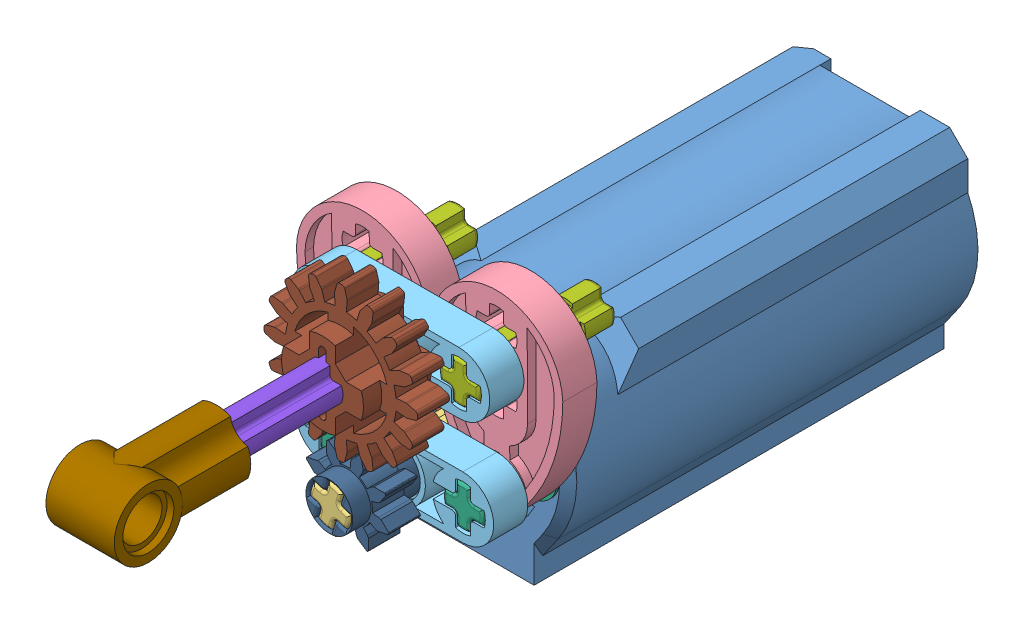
SolidWorks assembly 33.SLDASM, configuration 기본 (file format 9000). Lengths in mm.
Overall size (31.6 33.8 93.1).
15 component instances, 11 part files, 42 mates.
Components (placement in the parent):
- 9V Motor M-1: 9V Motor M.SLDPRT [기본] at (-8.7949 -0.4802 48.1336) size (24 24 48.27)
- Motor 9V  PF Medium part-1: Motor 9V  PF Medium part.SLDPRT [기본] at (-7.0482 -1.579 64.1336) x (0.956456 -0.291875 0) z (0 0 1) size (7 7 8)
- 4519 Axle 3-1: 4519 Axle 3.SLDPRT [기본] at (-8.7949 -0.4802 88.1336) x (0.956456 -0.291875 0) z (0.291875 0.956456 0) size (4.8 24.01 4.8)
- 6575 Cam-1: 6575 Cam.SLDPRT [기본] at (217.5093 473.1649 76.4336) x (-0.99999 -0.004375 0) z (0 0 1) size (15.5 22.95 4)
- 6632 Liftarm 1 x 3 Thin-1: 6632 Liftarm 1 x 3 Thin.SLDPRT [기본] at (-8.8298 -0.4802 80.4336) x (0.99999 0.004375 0) z (-0.004375 0.99999 0) size (23.2 4 7.2)
- 43093 Axle Pin with Friction Ridges Lengthwise-1: 43093 Axle Pin with Friction Ridges Lengthwise.SLDPRT [기본] at (-0.8299 -0.4452 72.4336) x (0.99999 0.004375 0) z (0.004375 -0.99999 0) size (6 16 6)
- 43093 Axle Pin with Friction Ridges Lengthwise-2: 43093 Axle Pin with Friction Ridges Lengthwise.SLDPRT [기본] at (-16.8297 -0.5152 72.4336) x (0.99999 0.004375 0) z (0.004375 -0.99999 0) size (6 16 6)
- 6575 Cam-2: 6575 Cam.SLDPRT [기본] at (201.5094 473.0949 76.1336) x (-0.99999 -0.004375 0) z (0 0 1) size (15.5 22.95 4)
- 32062 Axle 2 Notched-1: 32062 Axle 2 Notched.SLDPRT [기본] at (-0.8859 12.3547 80.8336) x (0.99999 0.004375 0) z (-0.004375 0.99999 0) size (4.8 16.01 4.8)
- 32062 Axle 2 Notched-2: 32062 Axle 2 Notched.SLDPRT [기본] at (-16.8857 12.2847 80.8336) x (0.99999 0.004375 0) z (-0.004375 0.99999 0) size (4.8 16.01 4.8)
- 6632 Liftarm 1 x 3 Thin-2: 6632 Liftarm 1 x 3 Thin.SLDPRT [기본] at (-8.8858 12.3197 80.8336) x (0.99999 0.004375 0) z (-0.004375 0.99999 0) size (23.2 4 7.2)
- 87083 Axle 4 w stop-1: 87083 Axle 4 w stop.SLDPRT [기본] at (-8.8858 12.3197 77.2336) x (1 0 0) z (0 -1 0) size (6 32.8 6)
- 32013 Axle pin connector angled #1-3: 32013 Axle pin connector angled #1.SLDPRT [기본] at (-8.8858 12.3197 101.2336) x (0 0 -1) z (1 0 0) size (16 8 8)
- 3647 Gear 8-1: 3647 Gear 8.SLDPRT [기본] at (-8.7949 -0.4802 84.1336) x (0.956456 -0.291875 0) z (0.291875 0.956456 0) size (10.06 8 10.06)
- 94925 Gear 16 old-1: 94925 Gear 16 old.SLDPRT [기본] at (-8.8858 12.3197 84.8336) x (1 0 0) z (0 -1 0) size (18 8 18)
Mates (geometry in assembly coordinates):
- 동심1: concentric: cylinder of 9V Motor M-1 through (-8.7949 -0.4802 72.1336) axis (0 0 1) radius 3.505; cylinder of Motor 9V  PF Medium part-1 through (-8.7949 -0.4802 72.1336) axis (0 0 -1) radius 3.5
- 일치1: coincident: plane of 9V Motor M-1 through (-8.7949 -0.4802 72.1336) normal (0 0 1); plane of Motor 9V  PF Medium part-1 through (-8.7949 -0.4802 72.1336) normal (0 0 1)
- 동심2: concentric: cylinder of 9V Motor M-1 through (-16.8299 -0.5152 72.1336) axis (0 0 1) radius 2.4; cylinder of 43093 Axle Pin with Friction Ridges Lengthwise-2 through (-16.8297 -0.5152 64.4336) axis (0 0 1) radius 2.4
- 일치2: coincident: plane of 9V Motor M-1 through (-14.4299 -0.5152 71.6336) normal (0 0 1); plane of 43093 Axle Pin with Friction Ridges Lengthwise-2 through (-16.8297 -0.5152 71.6336) normal (0 0 -1)
- 동심3: concentric: cylinder of 9V Motor M-1 through (-0.8299 -0.4452 72.1336) axis (0 0 1) radius 2.4; cylinder of 43093 Axle Pin with Friction Ridges Lengthwise-1 through (-0.8299 -0.4452 64.4336) axis (0 0 1) radius 2.4
- 일치3: coincident: plane of 9V Motor M-1 through (1.5701 -0.4452 71.6336) normal (0 0 1); plane of 43093 Axle Pin with Friction Ridges Lengthwise-1 through (-0.8299 -0.4452 71.6336) normal (0 0 -1)
- 동심4: concentric: cylinder of Motor 9V  PF Medium part-1 through (-8.7949 -0.4802 72.1336) axis (0 0 -1) radius 2.4; cylinder of 4519 Axle 3-1 through (-8.7949 -0.4802 64.1336) axis (0 0 1) radius 2.4
- 일치4: coincident: plane of Motor 9V  PF Medium part-1 through (-7.8275 -1.6955 72.1336) normal (0.291875 0.956456 0); plane of 4519 Axle 3-1 through (-8.2101 -1.5787 64.1336) normal (-0.291875 -0.956456 0)
- 일치5: coincident: circle of Motor 9V  PF Medium part-1; plane of 4519 Axle 3-1 through (-8.7949 -0.4802 64.1336) normal (0 0 -1)
- 동심5: concentric: cylinder of 6575 Cam-1 through (-0.8299 -0.4452 72.4336) axis (0 0 1) radius 2.4; cylinder of 43093 Axle Pin with Friction Ridges Lengthwise-1 through (-0.8299 -0.4452 80.4336) axis (0 0 -1) radius 2.4
- 평행2: parallel: plane of 6575 Cam-1 through (-1.6398 1.814 72.4336) normal (0.99999 0.004375 0); plane of 43093 Axle Pin with Friction Ridges Lengthwise-1 through (-1.7197 1.7838 80.4336) normal (-0.99999 -0.004375 0)
- 일치9: coincident: plane of 6575 Cam-1 through (5.751 12.0459 72.4336) normal (0 0 -1); plane of 43093 Axle Pin with Friction Ridges Lengthwise-1 through (-0.8299 -0.4452 72.4336) normal (0 0 1)
- 동심6: concentric: cylinder of 43093 Axle Pin with Friction Ridges Lengthwise-2 through (-16.8297 -0.5152 80.4336) axis (0 0 -1) radius 2.4; cylinder of 6575 Cam-2 through (-16.8297 -0.5152 72.1336) axis (0 0 1) radius 2.4
- 평행3: parallel: plane of 43093 Axle Pin with Friction Ridges Lengthwise-2 through (-14.6008 0.3746 80.4336) normal (-0.004375 0.99999 0); plane of 6575 Cam-2 through (-14.5705 0.2947 72.1336) normal (0.004375 -0.99999 0)
- 일치11: coincident: plane of 9V Motor M-1 through (-8.7949 -0.4802 72.1336) normal (0 0 1); plane of 6575 Cam-2 through (-10.2488 11.9759 72.1336) normal (0 0 -1)
- 동심7: concentric: cylinder of 6632 Liftarm 1 x 3 Thin-1 through (-0.8299 -0.4452 76.4336) axis (0 0 1) radius 2.6182; cylinder of 43093 Axle Pin with Friction Ridges Lengthwise-1 through (-0.8299 -0.4452 80.4336) axis (0 0 -1) radius 2.4
- 일치12: coincident: plane of 6632 Liftarm 1 x 3 Thin-1 through (0.4462 0.4404 76.4336) normal (0.004375 -0.99999 0); plane of 43093 Axle Pin with Friction Ridges Lengthwise-1 through (1.3991 0.4446 80.4336) normal (-0.004375 0.99999 0)
- 동심8: concentric: cylinder of 6632 Liftarm 1 x 3 Thin-1 through (-16.8297 -0.5152 76.4336) axis (0 0 1) radius 2.6182; cylinder of 43093 Axle Pin with Friction Ridges Lengthwise-2 through (-16.8297 -0.5152 80.4336) axis (0 0 -1) radius 2.4
- 일치13: coincident: plane of 6632 Liftarm 1 x 3 Thin-1 through (-15.9553 0.7687 76.4336) normal (-0.99999 -0.004375 0); plane of 43093 Axle Pin with Friction Ridges Lengthwise-2 through (-15.9553 0.7687 80.4336) normal (0.99999 0.004375 0)
- 일치14: coincident: plane of 6575 Cam-1 through (5.751 12.0459 76.4336) normal (0 0 1); plane of 6632 Liftarm 1 x 3 Thin-1 through (-16.8297 -0.5152 76.4336) normal (0 0 -1)
- 동심9: concentric: cylinder of 6575 Cam-1 through (-0.8859 12.3547 76.4336) axis (0 0 -1) radius 2.4; cylinder of 32062 Axle 2 Notched-1 through (-0.8859 12.3547 64.8336) axis (0 0 1) radius 2.4
- 평행4: parallel: plane of 6575 Cam-1 through (1.3803 11.5646 76.4336) normal (-0.004375 0.99999 0); plane of 32062 Axle 2 Notched-1 through (-0.002 11.4786 64.8336) normal (0.004375 -0.99999 0)
- 동심10: concentric: cylinder of 6575 Cam-2 through (-16.8857 12.2847 76.1336) axis (0 0 -1) radius 2.4; cylinder of 32062 Axle 2 Notched-2 through (-16.8857 12.2847 64.8336) axis (0 0 1) radius 2.4
- 평행5: parallel: plane of 6575 Cam-2 through (-17.6822 11.4812 76.1336) normal (-0.004375 0.99999 0); plane of 32062 Axle 2 Notched-2 through (-19.1147 11.3949 64.8336) normal (0.004375 -0.99999 0)
- 동심11: concentric: cylinder of 32062 Axle 2 Notched-1 through (-0.8859 12.3547 64.8336) axis (0 0 1) radius 2.4; cylinder of 6632 Liftarm 1 x 3 Thin-2 through (-0.8859 12.3547 76.8336) axis (0 0 1) radius 2.6182
- 일치17: coincident: plane of 32062 Axle 2 Notched-1 through (-0.002 11.4786 64.8336) normal (0.004375 -0.99999 0); plane of 6632 Liftarm 1 x 3 Thin-2 through (0.3979 11.4803 76.8336) normal (-0.004375 0.99999 0)
- 일치18: coincident: plane of 32062 Axle 2 Notched-1 through (-0.8859 12.3547 80.8336) normal (0 0 1); plane of 6632 Liftarm 1 x 3 Thin-2 through (-16.8857 12.2847 80.8336) normal (0 0 1)
- 동심12: concentric: cylinder of 32062 Axle 2 Notched-2 through (-16.8857 12.2847 64.8336) axis (0 0 1) radius 2.4; cylinder of 6632 Liftarm 1 x 3 Thin-2 through (-16.8857 12.2847 76.8336) axis (0 0 1) radius 2.6182
- 일치19: coincident: plane of 32062 Axle 2 Notched-2 through (-19.1147 11.3949 64.8336) normal (0.004375 -0.99999 0); plane of 6632 Liftarm 1 x 3 Thin-2 through (-19.3477 11.3939 76.8336) normal (-0.004375 0.99999 0)
- 일치20: coincident: plane of 32062 Axle 2 Notched-2 through (-16.8857 12.2847 80.8336) normal (0 0 1); plane of 6632 Liftarm 1 x 3 Thin-2 through (-16.8857 12.2847 80.8336) normal (0 0 1)
- 동심13: concentric: cylinder of 6632 Liftarm 1 x 3 Thin-2 through (-8.8858 12.3197 76.8336) axis (0 0 1) radius 2.6182; cylinder of 87083 Axle 4 w stop-1 through (-8.8858 12.3197 109.2336) axis (0 0 -1) radius 2.4
- 일치22: coincident: plane of 6632 Liftarm 1 x 3 Thin-2 through (-8.8858 12.3197 77.2336) normal (0 0 -1); plane of 87083 Axle 4 w stop-1 through (-8.8858 12.3197 77.2336) normal (0 0 1)
- 일치25: coincident: plane of 6575 Cam-1 through (5.751 12.0459 76.4336) normal (0 0 1); plane of 87083 Axle 4 w stop-1 through (-8.8858 12.3197 76.4336) normal (0 0 -1)
- 동심14: concentric: cylinder of 87083 Axle 4 w stop-1 through (-8.8858 12.3197 109.2336) axis (0 0 -1) radius 2.4; cylinder of 32013 Axle pin connector angled #1-3 through (-8.8858 12.3197 117.2346) axis (0 0 -1) radius 2.4
- 일치26: coincident: plane of 87083 Axle 4 w stop-1 through (-11.1187 13.1997 109.2336) normal (0 1 0); plane of 32013 Axle pin connector angled #1-3 through (-9.7658 13.1997 117.2346) normal (0 -1 0)
- 탄젠트1: tangent: plane of 87083 Axle 4 w stop-1 through (-8.8858 12.3197 109.2336) normal (0 0 1); cylinder of 32013 Axle pin connector angled #1-3 through (-12.8858 12.3197 113.2336) axis (1 0 0) radius 4
- 동심15: concentric: cylinder of 4519 Axle 3-1 through (-8.7949 -0.4802 64.1336) axis (0 0 1) radius 2.4; cylinder of 3647 Gear 8-1 through (-8.7949 -0.4802 88.1336) axis (0 0 -1) radius 2.4
- 일치27: coincident: plane of 4519 Axle 3-1 through (-8.2101 -1.5787 64.1336) normal (-0.291875 -0.956456 0); plane of 3647 Gear 8-1 through (-6.9161 -1.9736 88.1336) normal (0.291875 0.956456 0)
- 일치28: coincident: plane of 4519 Axle 3-1 through (-8.7949 -0.4802 88.1336) normal (0 0 1); plane of 3647 Gear 8-1 through (-8.7949 -0.4802 88.1336) normal (0 0 1)
- 동심16: concentric: cylinder of 87083 Axle 4 w stop-1 through (-8.8858 12.3197 109.2336) axis (0 0 -1) radius 2.4; cylinder of 94925 Gear 16 old-1 through (-8.8858 12.3197 80.8336) axis (0 0 1) radius 2.4
- 일치29: coincident: plane of 87083 Axle 4 w stop-1 through (-6.653 11.4397 109.2336) normal (0 -1 0); plane of 94925 Gear 16 old-1 through (-6.653 11.4397 80.8336) normal (0 1 0)
- 일치30: coincident: plane of 6632 Liftarm 1 x 3 Thin-2 through (-16.8857 12.2847 80.8336) normal (0 0 1); plane of 94925 Gear 16 old-1 through (-8.8858 12.3197 80.8336) normal (0 0 -1)
